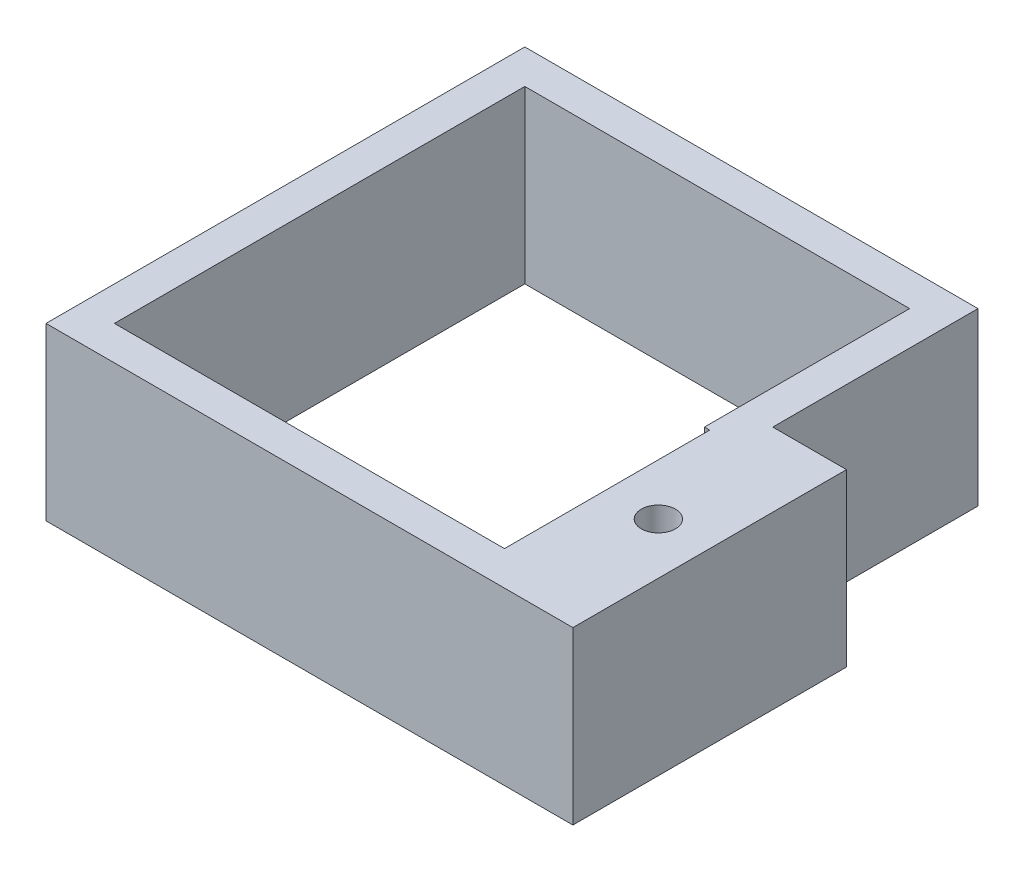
from build123d import *

# Parameters (mm, degrees)
BOSS_EXTRUDE1_DEPTH = 10
CUT_EXTRUDE1_DEPTH  = 43.816540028


with BuildPart() as part:
    # Sketch1 → Boss-Extrude1 (new body)
    with BuildSketch(Plane(origin=(0, 0, 0), x_dir=(1, 0, 0), z_dir=(0, 1, 0))):
        Polygon((0, 0), (0, 28), (26.5, 28), (26.5, 16), (30.81, 16), (30.81, 0), align=None)
        Polygon((24.81, 6.739099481), (24.81, 14), (24.5, 14), (24.5, 26), (2, 26), (2, 2), (24.81, 2), align=None, mode=Mode.SUBTRACT)
    extrude(amount=BOSS_EXTRUDE1_DEPTH)

    # Sketch2 → Cut-Extrude1 (cut, through all)
    with BuildSketch(Plane(origin=(0, 10, 0), x_dir=(1, 0, 0), z_dir=(0, 1, 0))):
        with BuildLine():
            ThreePointArc((28.257213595, 8.894427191), (27.81, 9), (27.362786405, 8.894427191))
            Line((27.362786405, 8.894427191), (27.81, 8))
            Line((27.81, 8), (28.257213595, 8.894427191))
        make_face()
        with BuildLine():
            Line((27.81, 8), (27.362786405, 8.894427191))
            ThreePointArc((27.362786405, 8.894427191), (26.81, 8), (27.362786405, 7.105572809))
            Line((27.362786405, 7.105572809), (27.81, 8))
        make_face()
        with BuildLine():
            ThreePointArc((28.81, 8), (28.660650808, 8.525731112), (28.257213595, 8.894427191))
            Line((28.257213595, 8.894427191), (27.81, 8))
            Line((27.81, 8), (28.257213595, 7.105572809))
            ThreePointArc((28.257213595, 7.105572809), (28.660650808, 7.474268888), (28.81, 8))
        make_face()
        with BuildLine():
            Line((27.81, 8), (27.362786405, 7.105572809))
            ThreePointArc((27.362786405, 7.105572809), (27.81, 7), (28.257213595, 7.105572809))
            Line((28.257213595, 7.105572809), (27.81, 8))
        make_face()
        with BuildLine():
            ThreePointArc((28.257213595, 8.894427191), (27.81, 9), (27.362786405, 8.894427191))
            Line((27.362786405, 8.894427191), (27.81, 8))
            Line((27.81, 8), (28.257213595, 8.894427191))
        make_face()
        with BuildLine():
            Line((27.81, 8), (27.362786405, 8.894427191))
            ThreePointArc((27.362786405, 8.894427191), (26.81, 8), (27.362786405, 7.105572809))
            Line((27.362786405, 7.105572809), (27.81, 8))
        make_face()
        with BuildLine():
            ThreePointArc((28.81, 8), (28.660650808, 8.525731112), (28.257213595, 8.894427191))
            Line((28.257213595, 8.894427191), (27.81, 8))
            Line((27.81, 8), (28.257213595, 7.105572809))
            ThreePointArc((28.257213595, 7.105572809), (28.660650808, 7.474268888), (28.81, 8))
        make_face()
        with BuildLine():
            Line((27.81, 8), (27.362786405, 7.105572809))
            ThreePointArc((27.362786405, 7.105572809), (27.81, 7), (28.257213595, 7.105572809))
            Line((28.257213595, 7.105572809), (27.81, 8))
        make_face()
        with BuildLine():
            ThreePointArc((28.257213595, 8.894427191), (27.81, 9), (27.362786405, 8.894427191))
            Line((27.362786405, 8.894427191), (27.81, 8))
            Line((27.81, 8), (28.257213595, 8.894427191))
        make_face()
        with BuildLine():
            Line((27.81, 8), (27.362786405, 8.894427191))
            ThreePointArc((27.362786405, 8.894427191), (26.81, 8), (27.362786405, 7.105572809))
            Line((27.362786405, 7.105572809), (27.81, 8))
        make_face()
        with BuildLine():
            ThreePointArc((28.81, 8), (28.660650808, 8.525731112), (28.257213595, 8.894427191))
            Line((28.257213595, 8.894427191), (27.81, 8))
            Line((27.81, 8), (28.257213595, 7.105572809))
            ThreePointArc((28.257213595, 7.105572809), (28.660650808, 7.474268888), (28.81, 8))
        make_face()
        with BuildLine():
            Line((27.81, 8), (27.362786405, 7.105572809))
            ThreePointArc((27.362786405, 7.105572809), (27.81, 7), (28.257213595, 7.105572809))
            Line((28.257213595, 7.105572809), (27.81, 8))
        make_face()
        with BuildLine():
            ThreePointArc((28.257213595, 8.894427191), (27.81, 9), (27.362786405, 8.894427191))
            Line((27.362786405, 8.894427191), (27.81, 8))
            Line((27.81, 8), (28.257213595, 8.894427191))
        make_face()
        with BuildLine():
            Line((27.81, 8), (27.362786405, 8.894427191))
            ThreePointArc((27.362786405, 8.894427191), (26.81, 8), (27.362786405, 7.105572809))
            Line((27.362786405, 7.105572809), (27.81, 8))
        make_face()
        with BuildLine():
            ThreePointArc((28.81, 8), (28.660650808, 8.525731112), (28.257213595, 8.894427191))
            Line((28.257213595, 8.894427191), (27.81, 8))
            Line((27.81, 8), (28.257213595, 7.105572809))
            ThreePointArc((28.257213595, 7.105572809), (28.660650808, 7.474268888), (28.81, 8))
        make_face()
        with BuildLine():
            Line((27.81, 8), (27.362786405, 7.105572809))
            ThreePointArc((27.362786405, 7.105572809), (27.81, 7), (28.257213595, 7.105572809))
            Line((28.257213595, 7.105572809), (27.81, 8))
        make_face()
    extrude(amount=-CUT_EXTRUDE1_DEPTH, mode=Mode.SUBTRACT)


solid = part.part
